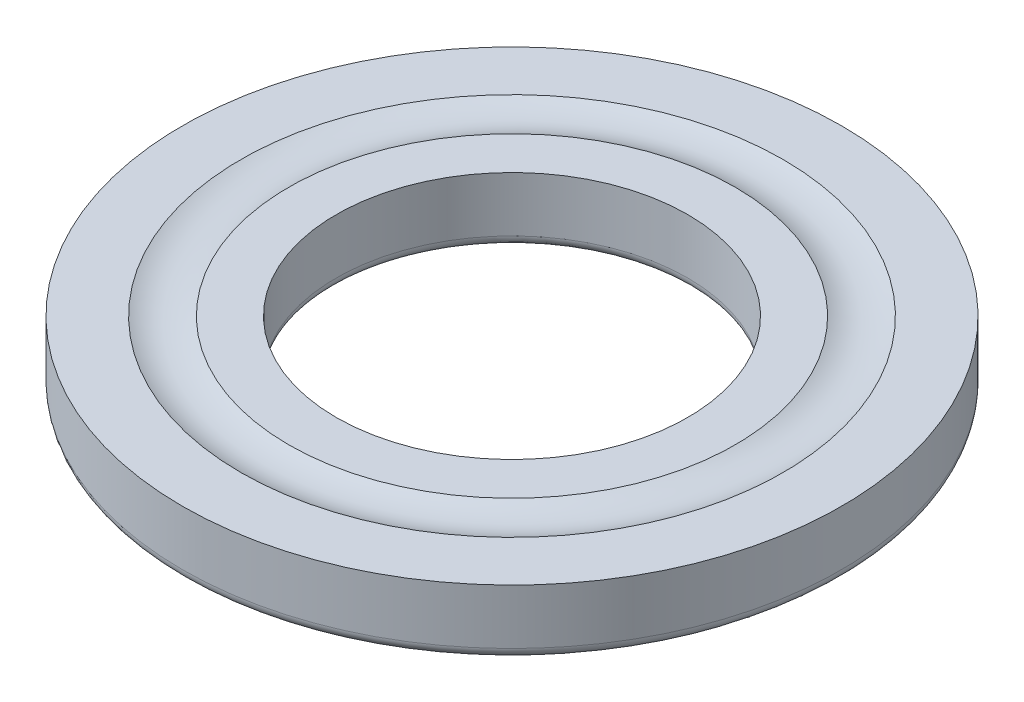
ISO-10303-21;
HEADER;
FILE_DESCRIPTION(('STEP AP214'),'2;1');
FILE_NAME('part.step','',(''),(''),'','','');
FILE_SCHEMA(('AUTOMOTIVE_DESIGN { 1 0 10303 214 1 1 1 1 }'));
ENDSEC;
DATA;
#1=APPLICATION_CONTEXT('core data for automotive mechanical design processes');
#2=APPLICATION_PROTOCOL_DEFINITION('international standard','automotive_design',2000,#1);
#3=PRODUCT_CONTEXT('',#1,'mechanical');
#4=PRODUCT('Part','Part','',(#3));
#5=PRODUCT_RELATED_PRODUCT_CATEGORY('part','',(#4));
#6=PRODUCT_DEFINITION_FORMATION('','',#4);
#7=PRODUCT_DEFINITION_CONTEXT('part definition',#1,'design');
#8=PRODUCT_DEFINITION('design','',#6,#7);
#9=PRODUCT_DEFINITION_SHAPE('','',#8);
#10=(LENGTH_UNIT() NAMED_UNIT(*) SI_UNIT(.MILLI.,.METRE.));
#11=(NAMED_UNIT(*) PLANE_ANGLE_UNIT() SI_UNIT($,.RADIAN.));
#12=(NAMED_UNIT(*) SI_UNIT($,.STERADIAN.) SOLID_ANGLE_UNIT());
#13=UNCERTAINTY_MEASURE_WITH_UNIT(LENGTH_MEASURE(1.E-05),#10,'distance_accuracy_value','');
#14=(GEOMETRIC_REPRESENTATION_CONTEXT(3) GLOBAL_UNCERTAINTY_ASSIGNED_CONTEXT((#13)) GLOBAL_UNIT_ASSIGNED_CONTEXT((#10,
#11,#12)) REPRESENTATION_CONTEXT('',''));
#15=CARTESIAN_POINT('',(0.,0.,0.));
#16=DIRECTION('',(0.,0.,1.));
#17=DIRECTION('',(1.,0.,0.));
#18=AXIS2_PLACEMENT_3D('',#15,#16,#17);
#19=CARTESIAN_POINT('',(0.,6.,0.));
#20=DIRECTION('',(0.,1.,0.));
#21=DIRECTION('',(0.,0.,1.));
#22=AXIS2_PLACEMENT_3D('',#19,#20,#21);
#23=CYLINDRICAL_SURFACE('',#22,30.);
#24=CARTESIAN_POINT('',(0.,1.,0.));
#25=DIRECTION('',(0.,1.,0.));
#26=DIRECTION('',(0.,0.,1.));
#27=AXIS2_PLACEMENT_3D('',#24,#25,#26);
#28=CIRCLE('',#27,30.);
#29=CARTESIAN_POINT('',(0.,1.,30.));
#30=VERTEX_POINT('',#29);
#31=EDGE_CURVE('E5',#30,#30,#28,.T.);
#32=ORIENTED_EDGE('',*,*,#31,.T.);
#33=EDGE_LOOP('',(#32));
#34=FACE_BOUND('',#33,.T.);
#35=CARTESIAN_POINT('',(0.,6.,0.));
#36=DIRECTION('',(0.,1.,0.));
#37=DIRECTION('',(0.,0.,1.));
#38=AXIS2_PLACEMENT_3D('',#35,#36,#37);
#39=CIRCLE('',#38,30.);
#40=CARTESIAN_POINT('',(0.,6.,30.));
#41=VERTEX_POINT('',#40);
#42=EDGE_CURVE('E9',#41,#41,#39,.T.);
#43=ORIENTED_EDGE('',*,*,#42,.F.);
#44=EDGE_LOOP('',(#43));
#45=FACE_BOUND('',#44,.T.);
#46=ADVANCED_FACE('F13',(#34,#45),#23,.T.);
#47=CARTESIAN_POINT('',(0.,0.999999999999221,0.));
#48=DIRECTION('',(0.,1.,0.));
#49=DIRECTION('',(0.,0.,1.));
#50=AXIS2_PLACEMENT_3D('',#47,#48,#49);
#51=TOROIDAL_SURFACE('',#50,29.0000000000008,0.99999999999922);
#52=CARTESIAN_POINT('',(0.,0.,0.));
#53=DIRECTION('',(0.,1.,0.));
#54=DIRECTION('',(0.,0.,1.));
#55=AXIS2_PLACEMENT_3D('',#52,#53,#54);
#56=CIRCLE('',#55,29.0000000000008);
#57=CARTESIAN_POINT('',(0.,0.,29.0000000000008));
#58=VERTEX_POINT('',#57);
#59=EDGE_CURVE('E24',#58,#58,#56,.T.);
#60=ORIENTED_EDGE('',*,*,#59,.T.);
#61=EDGE_LOOP('',(#60));
#62=FACE_BOUND('',#61,.T.);
#63=ORIENTED_EDGE('',*,*,#31,.F.);
#64=EDGE_LOOP('',(#63));
#65=FACE_BOUND('',#64,.T.);
#66=ADVANCED_FACE('F30',(#62,#65),#51,.T.);
#67=CARTESIAN_POINT('',(-24.681742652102,6.,0.));
#68=DIRECTION('',(0.,1.,0.));
#69=DIRECTION('',(0.,0.,1.));
#70=AXIS2_PLACEMENT_3D('',#67,#68,#69);
#71=PLANE('',#70);
#72=ORIENTED_EDGE('',*,*,#42,.T.);
#73=EDGE_LOOP('',(#72));
#74=FACE_BOUND('',#73,.T.);
#75=CARTESIAN_POINT('',(0.,6.,0.));
#76=DIRECTION('',(0.,1.,0.));
#77=DIRECTION('',(0.,0.,1.));
#78=AXIS2_PLACEMENT_3D('',#75,#76,#77);
#79=CIRCLE('',#78,24.681742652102);
#80=CARTESIAN_POINT('',(0.,6.,24.681742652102));
#81=VERTEX_POINT('',#80);
#82=EDGE_CURVE('E39',#81,#81,#79,.T.);
#83=ORIENTED_EDGE('',*,*,#82,.F.);
#84=EDGE_LOOP('',(#83));
#85=FACE_BOUND('',#84,.T.);
#86=ADVANCED_FACE('F43',(#74,#85),#71,.T.);
#87=CARTESIAN_POINT('',(-29.,0.,0.));
#88=DIRECTION('',(0.,-1.,0.));
#89=DIRECTION('',(0.,0.,-1.));
#90=AXIS2_PLACEMENT_3D('',#87,#88,#89);
#91=PLANE('',#90);
#92=CARTESIAN_POINT('',(0.,0.,0.));
#93=DIRECTION('',(0.,1.,0.));
#94=DIRECTION('',(0.,0.,1.));
#95=AXIS2_PLACEMENT_3D('',#92,#93,#94);
#96=CIRCLE('',#95,16.9999999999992);
#97=CARTESIAN_POINT('',(0.,0.,16.9999999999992));
#98=VERTEX_POINT('',#97);
#99=EDGE_CURVE('E50',#98,#98,#96,.T.);
#100=ORIENTED_EDGE('',*,*,#99,.T.);
#101=EDGE_LOOP('',(#100));
#102=FACE_BOUND('',#101,.T.);
#103=ORIENTED_EDGE('',*,*,#59,.F.);
#104=EDGE_LOOP('',(#103));
#105=FACE_BOUND('',#104,.T.);
#106=ADVANCED_FACE('F56',(#102,#105),#91,.T.);
#107=CARTESIAN_POINT('',(0.,10.500000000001,0.));
#108=DIRECTION('',(0.,1.,0.));
#109=DIRECTION('',(0.,0.,1.));
#110=AXIS2_PLACEMENT_3D('',#107,#108,#109);
#111=TOROIDAL_SURFACE('',#110,22.5,5.00100000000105);
#112=CARTESIAN_POINT('',(0.,6.,0.));
#113=DIRECTION('',(0.,1.,0.));
#114=DIRECTION('',(0.,0.,1.));
#115=AXIS2_PLACEMENT_3D('',#112,#113,#114);
#116=CIRCLE('',#115,20.318257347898);
#117=CARTESIAN_POINT('',(0.,6.,20.318257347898));
#118=VERTEX_POINT('',#117);
#119=EDGE_CURVE('E63',#118,#118,#116,.T.);
#120=ORIENTED_EDGE('',*,*,#119,.F.);
#121=EDGE_LOOP('',(#120));
#122=FACE_BOUND('',#121,.T.);
#123=ORIENTED_EDGE('',*,*,#82,.T.);
#124=EDGE_LOOP('',(#123));
#125=FACE_BOUND('',#124,.T.);
#126=ADVANCED_FACE('F69',(#122,#125),#111,.F.);
#127=CARTESIAN_POINT('',(0.,0.999999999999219,0.));
#128=DIRECTION('',(0.,1.,0.));
#129=DIRECTION('',(0.,0.,1.));
#130=AXIS2_PLACEMENT_3D('',#127,#128,#129);
#131=TOROIDAL_SURFACE('',#130,16.9999999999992,0.999999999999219);
#132=CARTESIAN_POINT('',(0.,1.,0.));
#133=DIRECTION('',(0.,1.,0.));
#134=DIRECTION('',(0.,0.,1.));
#135=AXIS2_PLACEMENT_3D('',#132,#133,#134);
#136=CIRCLE('',#135,16.);
#137=CARTESIAN_POINT('',(0.,1.,16.));
#138=VERTEX_POINT('',#137);
#139=EDGE_CURVE('E76',#138,#138,#136,.T.);
#140=ORIENTED_EDGE('',*,*,#139,.T.);
#141=EDGE_LOOP('',(#140));
#142=FACE_BOUND('',#141,.T.);
#143=ORIENTED_EDGE('',*,*,#99,.F.);
#144=EDGE_LOOP('',(#143));
#145=FACE_BOUND('',#144,.T.);
#146=ADVANCED_FACE('F82',(#142,#145),#131,.T.);
#147=CARTESIAN_POINT('',(-16.,6.,0.));
#148=DIRECTION('',(0.,1.,0.));
#149=DIRECTION('',(0.,0.,1.));
#150=AXIS2_PLACEMENT_3D('',#147,#148,#149);
#151=PLANE('',#150);
#152=ORIENTED_EDGE('',*,*,#119,.T.);
#153=EDGE_LOOP('',(#152));
#154=FACE_BOUND('',#153,.T.);
#155=CARTESIAN_POINT('',(0.,6.,0.));
#156=DIRECTION('',(0.,1.,0.));
#157=DIRECTION('',(0.,0.,1.));
#158=AXIS2_PLACEMENT_3D('',#155,#156,#157);
#159=CIRCLE('',#158,16.);
#160=CARTESIAN_POINT('',(0.,6.,16.));
#161=VERTEX_POINT('',#160);
#162=EDGE_CURVE('E91',#161,#161,#159,.T.);
#163=ORIENTED_EDGE('',*,*,#162,.F.);
#164=EDGE_LOOP('',(#163));
#165=FACE_BOUND('',#164,.T.);
#166=ADVANCED_FACE('F95',(#154,#165),#151,.T.);
#167=CARTESIAN_POINT('',(0.,6.,0.));
#168=DIRECTION('',(0.,1.,0.));
#169=DIRECTION('',(0.,0.,1.));
#170=AXIS2_PLACEMENT_3D('',#167,#168,#169);
#171=CYLINDRICAL_SURFACE('',#170,16.);
#172=ORIENTED_EDGE('',*,*,#162,.T.);
#173=EDGE_LOOP('',(#172));
#174=FACE_BOUND('',#173,.T.);
#175=ORIENTED_EDGE('',*,*,#139,.F.);
#176=EDGE_LOOP('',(#175));
#177=FACE_BOUND('',#176,.T.);
#178=ADVANCED_FACE('F106',(#174,#177),#171,.F.);
#179=CLOSED_SHELL('',(#46,#66,#86,#106,#126,#146,#166,#178));
#180=MANIFOLD_SOLID_BREP('B1',#179);
#181=ADVANCED_BREP_SHAPE_REPRESENTATION('',(#18,#180),#14);
#182=SHAPE_DEFINITION_REPRESENTATION(#9,#181);
ENDSEC;
END-ISO-10303-21;
